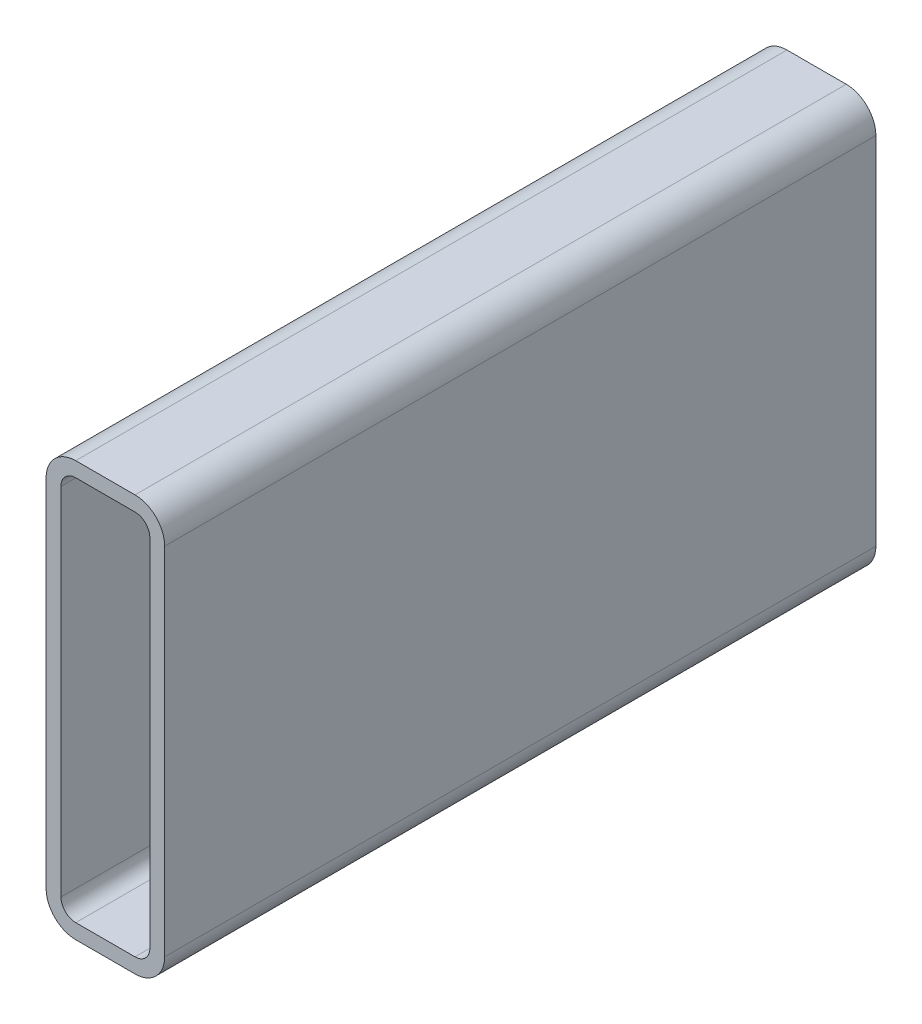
ISO-10303-21;
HEADER;
FILE_DESCRIPTION(('STEP AP214'),'2;1');
FILE_NAME('part.step','',(''),(''),'','','');
FILE_SCHEMA(('AUTOMOTIVE_DESIGN { 1 0 10303 214 1 1 1 1 }'));
ENDSEC;
DATA;
#1=APPLICATION_CONTEXT('core data for automotive mechanical design processes');
#2=APPLICATION_PROTOCOL_DEFINITION('international standard','automotive_design',2000,#1);
#3=PRODUCT_CONTEXT('',#1,'mechanical');
#4=PRODUCT('Part','Part','',(#3));
#5=PRODUCT_RELATED_PRODUCT_CATEGORY('part','',(#4));
#6=PRODUCT_DEFINITION_FORMATION('','',#4);
#7=PRODUCT_DEFINITION_CONTEXT('part definition',#1,'design');
#8=PRODUCT_DEFINITION('design','',#6,#7);
#9=PRODUCT_DEFINITION_SHAPE('','',#8);
#10=(LENGTH_UNIT() NAMED_UNIT(*) SI_UNIT(.MILLI.,.METRE.));
#11=(NAMED_UNIT(*) PLANE_ANGLE_UNIT() SI_UNIT($,.RADIAN.));
#12=(NAMED_UNIT(*) SI_UNIT($,.STERADIAN.) SOLID_ANGLE_UNIT());
#13=UNCERTAINTY_MEASURE_WITH_UNIT(LENGTH_MEASURE(1.E-05),#10,'distance_accuracy_value','');
#14=(GEOMETRIC_REPRESENTATION_CONTEXT(3) GLOBAL_UNCERTAINTY_ASSIGNED_CONTEXT((#13)) GLOBAL_UNIT_ASSIGNED_CONTEXT((#10,
#11,#12)) REPRESENTATION_CONTEXT('',''));
#15=CARTESIAN_POINT('',(0.,0.,0.));
#16=DIRECTION('',(0.,0.,1.));
#17=DIRECTION('',(1.,0.,0.));
#18=AXIS2_PLACEMENT_3D('',#15,#16,#17);
#19=CARTESIAN_POINT('',(12.7,165.1,304.8));
#20=DIRECTION('',(0.,0.,1.));
#21=DIRECTION('',(1.,0.,0.));
#22=AXIS2_PLACEMENT_3D('',#19,#20,#21);
#23=PLANE('',#22);
#24=CARTESIAN_POINT('',(12.7,165.1,304.8));
#25=DIRECTION('',(0.,0.,1.));
#26=DIRECTION('',(1.,0.,0.));
#27=AXIS2_PLACEMENT_3D('',#24,#25,#26);
#28=CIRCLE('',#27,12.7);
#29=CARTESIAN_POINT('',(12.7,177.8,304.8));
#30=VERTEX_POINT('',#29);
#31=CARTESIAN_POINT('',(0.,165.1,304.8));
#32=VERTEX_POINT('',#31);
#33=EDGE_CURVE('E211',#30,#32,#28,.T.);
#34=ORIENTED_EDGE('',*,*,#33,.T.);
#35=DIRECTION('',(0.,-1.,0.));
#36=VECTOR('',#35,1.);
#37=CARTESIAN_POINT('',(0.,12.7,304.8));
#38=LINE('',#37,#36);
#39=CARTESIAN_POINT('',(0.,12.7,304.8));
#40=VERTEX_POINT('',#39);
#41=EDGE_CURVE('E214',#32,#40,#38,.T.);
#42=ORIENTED_EDGE('',*,*,#41,.T.);
#43=CARTESIAN_POINT('',(12.7,12.7,304.8));
#44=DIRECTION('',(0.,0.,1.));
#45=DIRECTION('',(1.,0.,0.));
#46=AXIS2_PLACEMENT_3D('',#43,#44,#45);
#47=CIRCLE('',#46,12.7);
#48=CARTESIAN_POINT('',(12.7,0.,304.8));
#49=VERTEX_POINT('',#48);
#50=EDGE_CURVE('E217',#40,#49,#47,.T.);
#51=ORIENTED_EDGE('',*,*,#50,.T.);
#52=DIRECTION('',(1.,0.,0.));
#53=VECTOR('',#52,1.);
#54=CARTESIAN_POINT('',(38.1,0.,304.8));
#55=LINE('',#54,#53);
#56=CARTESIAN_POINT('',(38.1,0.,304.8));
#57=VERTEX_POINT('',#56);
#58=EDGE_CURVE('E219',#49,#57,#55,.T.);
#59=ORIENTED_EDGE('',*,*,#58,.T.);
#60=CARTESIAN_POINT('',(38.1,12.7,304.8));
#61=DIRECTION('',(0.,0.,1.));
#62=DIRECTION('',(1.,0.,0.));
#63=AXIS2_PLACEMENT_3D('',#60,#61,#62);
#64=CIRCLE('',#63,12.7);
#65=CARTESIAN_POINT('',(50.8,12.7,304.8));
#66=VERTEX_POINT('',#65);
#67=EDGE_CURVE('E221',#57,#66,#64,.T.);
#68=ORIENTED_EDGE('',*,*,#67,.T.);
#69=DIRECTION('',(0.,1.,0.));
#70=VECTOR('',#69,1.);
#71=CARTESIAN_POINT('',(50.8,165.1,304.8));
#72=LINE('',#71,#70);
#73=CARTESIAN_POINT('',(50.8,165.1,304.8));
#74=VERTEX_POINT('',#73);
#75=EDGE_CURVE('E223',#66,#74,#72,.T.);
#76=ORIENTED_EDGE('',*,*,#75,.T.);
#77=CARTESIAN_POINT('',(38.1,165.1,304.8));
#78=DIRECTION('',(0.,0.,1.));
#79=DIRECTION('',(1.,0.,0.));
#80=AXIS2_PLACEMENT_3D('',#77,#78,#79);
#81=CIRCLE('',#80,12.7);
#82=CARTESIAN_POINT('',(38.1,177.8,304.8));
#83=VERTEX_POINT('',#82);
#84=EDGE_CURVE('E225',#74,#83,#81,.T.);
#85=ORIENTED_EDGE('',*,*,#84,.T.);
#86=DIRECTION('',(-1.,0.,0.));
#87=VECTOR('',#86,1.);
#88=CARTESIAN_POINT('',(12.7,177.8,304.8));
#89=LINE('',#88,#87);
#90=EDGE_CURVE('E227',#83,#30,#89,.T.);
#91=ORIENTED_EDGE('',*,*,#90,.T.);
#92=EDGE_LOOP('',(#34,#42,#51,#59,#68,#76,#85,#91));
#93=FACE_BOUND('',#92,.T.);
#94=DIRECTION('',(0.,-1.,0.));
#95=VECTOR('',#94,1.);
#96=CARTESIAN_POINT('',(6.35,12.7,304.8));
#97=LINE('',#96,#95);
#98=CARTESIAN_POINT('',(6.35,165.1,304.8));
#99=VERTEX_POINT('',#98);
#100=CARTESIAN_POINT('',(6.35,12.7,304.8));
#101=VERTEX_POINT('',#100);
#102=EDGE_CURVE('E154',#99,#101,#97,.T.);
#103=ORIENTED_EDGE('',*,*,#102,.F.);
#104=CARTESIAN_POINT('',(12.7,165.1,304.8));
#105=DIRECTION('',(0.,0.,1.));
#106=DIRECTION('',(1.,0.,0.));
#107=AXIS2_PLACEMENT_3D('',#104,#105,#106);
#108=CIRCLE('',#107,6.34999999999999);
#109=CARTESIAN_POINT('',(12.7,171.45,304.8));
#110=VERTEX_POINT('',#109);
#111=EDGE_CURVE('E146',#110,#99,#108,.T.);
#112=ORIENTED_EDGE('',*,*,#111,.F.);
#113=DIRECTION('',(-1.,0.,0.));
#114=VECTOR('',#113,1.);
#115=CARTESIAN_POINT('',(12.7,171.45,304.8));
#116=LINE('',#115,#114);
#117=CARTESIAN_POINT('',(38.1,171.45,304.8));
#118=VERTEX_POINT('',#117);
#119=EDGE_CURVE('E179',#118,#110,#116,.T.);
#120=ORIENTED_EDGE('',*,*,#119,.F.);
#121=CARTESIAN_POINT('',(38.1,165.1,304.8));
#122=DIRECTION('',(0.,0.,1.));
#123=DIRECTION('',(1.,0.,0.));
#124=AXIS2_PLACEMENT_3D('',#121,#122,#123);
#125=CIRCLE('',#124,6.34999999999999);
#126=CARTESIAN_POINT('',(44.45,165.1,304.8));
#127=VERTEX_POINT('',#126);
#128=EDGE_CURVE('E177',#127,#118,#125,.T.);
#129=ORIENTED_EDGE('',*,*,#128,.F.);
#130=DIRECTION('',(0.,1.,0.));
#131=VECTOR('',#130,1.);
#132=CARTESIAN_POINT('',(44.45,165.1,304.8));
#133=LINE('',#132,#131);
#134=CARTESIAN_POINT('',(44.45,12.7,304.8));
#135=VERTEX_POINT('',#134);
#136=EDGE_CURVE('E175',#135,#127,#133,.T.);
#137=ORIENTED_EDGE('',*,*,#136,.F.);
#138=CARTESIAN_POINT('',(38.1,12.7,304.8));
#139=DIRECTION('',(0.,0.,1.));
#140=DIRECTION('',(1.,0.,0.));
#141=AXIS2_PLACEMENT_3D('',#138,#139,#140);
#142=CIRCLE('',#141,6.35);
#143=CARTESIAN_POINT('',(38.1,6.35,304.8));
#144=VERTEX_POINT('',#143);
#145=EDGE_CURVE('E173',#144,#135,#142,.T.);
#146=ORIENTED_EDGE('',*,*,#145,.F.);
#147=DIRECTION('',(1.,0.,0.));
#148=VECTOR('',#147,1.);
#149=CARTESIAN_POINT('',(38.1,6.35,304.8));
#150=LINE('',#149,#148);
#151=CARTESIAN_POINT('',(12.7,6.35,304.8));
#152=VERTEX_POINT('',#151);
#153=EDGE_CURVE('E169',#152,#144,#150,.T.);
#154=ORIENTED_EDGE('',*,*,#153,.F.);
#155=CARTESIAN_POINT('',(12.7,12.7,304.8));
#156=DIRECTION('',(0.,0.,1.));
#157=DIRECTION('',(1.,0.,0.));
#158=AXIS2_PLACEMENT_3D('',#155,#156,#157);
#159=CIRCLE('',#158,6.35);
#160=EDGE_CURVE('E167',#101,#152,#159,.T.);
#161=ORIENTED_EDGE('',*,*,#160,.F.);
#162=EDGE_LOOP('',(#103,#112,#120,#129,#137,#146,#154,#161));
#163=FACE_BOUND('',#162,.T.);
#164=ADVANCED_FACE('F33',(#93,#163),#23,.T.);
#165=CARTESIAN_POINT('',(12.7,165.1,0.));
#166=DIRECTION('',(0.,0.,1.));
#167=DIRECTION('',(1.,0.,0.));
#168=AXIS2_PLACEMENT_3D('',#165,#166,#167);
#169=PLANE('',#168);
#170=CARTESIAN_POINT('',(12.7,165.1,0.));
#171=DIRECTION('',(0.,0.,1.));
#172=DIRECTION('',(1.,0.,0.));
#173=AXIS2_PLACEMENT_3D('',#170,#171,#172);
#174=CIRCLE('',#173,12.7);
#175=CARTESIAN_POINT('',(12.7,177.8,0.));
#176=VERTEX_POINT('',#175);
#177=CARTESIAN_POINT('',(0.,165.1,0.));
#178=VERTEX_POINT('',#177);
#179=EDGE_CURVE('E162',#176,#178,#174,.T.);
#180=ORIENTED_EDGE('',*,*,#179,.F.);
#181=DIRECTION('',(-1.,0.,0.));
#182=VECTOR('',#181,1.);
#183=CARTESIAN_POINT('',(12.7,177.8,0.));
#184=LINE('',#183,#182);
#185=CARTESIAN_POINT('',(38.1,177.8,0.));
#186=VERTEX_POINT('',#185);
#187=EDGE_CURVE('E215',#186,#176,#184,.T.);
#188=ORIENTED_EDGE('',*,*,#187,.F.);
#189=CARTESIAN_POINT('',(38.1,165.1,0.));
#190=DIRECTION('',(0.,0.,1.));
#191=DIRECTION('',(1.,0.,0.));
#192=AXIS2_PLACEMENT_3D('',#189,#190,#191);
#193=CIRCLE('',#192,12.7);
#194=CARTESIAN_POINT('',(50.8,165.1,0.));
#195=VERTEX_POINT('',#194);
#196=EDGE_CURVE('E242',#195,#186,#193,.T.);
#197=ORIENTED_EDGE('',*,*,#196,.F.);
#198=DIRECTION('',(0.,1.,0.));
#199=VECTOR('',#198,1.);
#200=CARTESIAN_POINT('',(50.8,165.1,0.));
#201=LINE('',#200,#199);
#202=CARTESIAN_POINT('',(50.8,12.7,0.));
#203=VERTEX_POINT('',#202);
#204=EDGE_CURVE('E240',#203,#195,#201,.T.);
#205=ORIENTED_EDGE('',*,*,#204,.F.);
#206=CARTESIAN_POINT('',(38.1,12.7,0.));
#207=DIRECTION('',(0.,0.,1.));
#208=DIRECTION('',(1.,0.,0.));
#209=AXIS2_PLACEMENT_3D('',#206,#207,#208);
#210=CIRCLE('',#209,12.7);
#211=CARTESIAN_POINT('',(38.1,0.,0.));
#212=VERTEX_POINT('',#211);
#213=EDGE_CURVE('E238',#212,#203,#210,.T.);
#214=ORIENTED_EDGE('',*,*,#213,.F.);
#215=DIRECTION('',(1.,0.,0.));
#216=VECTOR('',#215,1.);
#217=CARTESIAN_POINT('',(38.1,0.,0.));
#218=LINE('',#217,#216);
#219=CARTESIAN_POINT('',(12.7,0.,0.));
#220=VERTEX_POINT('',#219);
#221=EDGE_CURVE('E236',#220,#212,#218,.T.);
#222=ORIENTED_EDGE('',*,*,#221,.F.);
#223=CARTESIAN_POINT('',(12.7,12.7,0.));
#224=DIRECTION('',(0.,0.,1.));
#225=DIRECTION('',(1.,0.,0.));
#226=AXIS2_PLACEMENT_3D('',#223,#224,#225);
#227=CIRCLE('',#226,12.7);
#228=CARTESIAN_POINT('',(0.,12.7,0.));
#229=VERTEX_POINT('',#228);
#230=EDGE_CURVE('E234',#229,#220,#227,.T.);
#231=ORIENTED_EDGE('',*,*,#230,.F.);
#232=DIRECTION('',(0.,-1.,0.));
#233=VECTOR('',#232,1.);
#234=CARTESIAN_POINT('',(0.,12.7,0.));
#235=LINE('',#234,#233);
#236=EDGE_CURVE('E232',#178,#229,#235,.T.);
#237=ORIENTED_EDGE('',*,*,#236,.F.);
#238=EDGE_LOOP('',(#180,#188,#197,#205,#214,#222,#231,#237));
#239=FACE_BOUND('',#238,.T.);
#240=CARTESIAN_POINT('',(12.7,165.1,0.));
#241=DIRECTION('',(0.,0.,1.));
#242=DIRECTION('',(1.,0.,0.));
#243=AXIS2_PLACEMENT_3D('',#240,#241,#242);
#244=CIRCLE('',#243,6.34999999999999);
#245=CARTESIAN_POINT('',(12.7,171.45,0.));
#246=VERTEX_POINT('',#245);
#247=CARTESIAN_POINT('',(6.35,165.1,0.));
#248=VERTEX_POINT('',#247);
#249=EDGE_CURVE('E56',#246,#248,#244,.T.);
#250=ORIENTED_EDGE('',*,*,#249,.T.);
#251=DIRECTION('',(0.,-1.,0.));
#252=VECTOR('',#251,1.);
#253=CARTESIAN_POINT('',(6.35,12.7,0.));
#254=LINE('',#253,#252);
#255=CARTESIAN_POINT('',(6.35,12.7,0.));
#256=VERTEX_POINT('',#255);
#257=EDGE_CURVE('E161',#248,#256,#254,.T.);
#258=ORIENTED_EDGE('',*,*,#257,.T.);
#259=CARTESIAN_POINT('',(12.7,12.7,0.));
#260=DIRECTION('',(0.,0.,1.));
#261=DIRECTION('',(1.,0.,0.));
#262=AXIS2_PLACEMENT_3D('',#259,#260,#261);
#263=CIRCLE('',#262,6.35);
#264=CARTESIAN_POINT('',(12.7,6.35,0.));
#265=VERTEX_POINT('',#264);
#266=EDGE_CURVE('E183',#256,#265,#263,.T.);
#267=ORIENTED_EDGE('',*,*,#266,.T.);
#268=DIRECTION('',(1.,0.,0.));
#269=VECTOR('',#268,1.);
#270=CARTESIAN_POINT('',(38.1,6.35,0.));
#271=LINE('',#270,#269);
#272=CARTESIAN_POINT('',(38.1,6.35,0.));
#273=VERTEX_POINT('',#272);
#274=EDGE_CURVE('E186',#265,#273,#271,.T.);
#275=ORIENTED_EDGE('',*,*,#274,.T.);
#276=CARTESIAN_POINT('',(38.1,12.7,0.));
#277=DIRECTION('',(0.,0.,1.));
#278=DIRECTION('',(1.,0.,0.));
#279=AXIS2_PLACEMENT_3D('',#276,#277,#278);
#280=CIRCLE('',#279,6.35);
#281=CARTESIAN_POINT('',(44.45,12.7,0.));
#282=VERTEX_POINT('',#281);
#283=EDGE_CURVE('E189',#273,#282,#280,.T.);
#284=ORIENTED_EDGE('',*,*,#283,.T.);
#285=DIRECTION('',(0.,1.,0.));
#286=VECTOR('',#285,1.);
#287=CARTESIAN_POINT('',(44.45,165.1,0.));
#288=LINE('',#287,#286);
#289=CARTESIAN_POINT('',(44.45,165.1,0.));
#290=VERTEX_POINT('',#289);
#291=EDGE_CURVE('E192',#282,#290,#288,.T.);
#292=ORIENTED_EDGE('',*,*,#291,.T.);
#293=CARTESIAN_POINT('',(38.1,165.1,0.));
#294=DIRECTION('',(0.,0.,1.));
#295=DIRECTION('',(1.,0.,0.));
#296=AXIS2_PLACEMENT_3D('',#293,#294,#295);
#297=CIRCLE('',#296,6.34999999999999);
#298=CARTESIAN_POINT('',(38.1,171.45,0.));
#299=VERTEX_POINT('',#298);
#300=EDGE_CURVE('E195',#290,#299,#297,.T.);
#301=ORIENTED_EDGE('',*,*,#300,.T.);
#302=DIRECTION('',(-1.,0.,0.));
#303=VECTOR('',#302,1.);
#304=CARTESIAN_POINT('',(12.7,171.45,0.));
#305=LINE('',#304,#303);
#306=EDGE_CURVE('E155',#299,#246,#305,.T.);
#307=ORIENTED_EDGE('',*,*,#306,.T.);
#308=EDGE_LOOP('',(#250,#258,#267,#275,#284,#292,#301,#307));
#309=FACE_BOUND('',#308,.T.);
#310=ADVANCED_FACE('F272',(#239,#309),#169,.F.);
#311=CARTESIAN_POINT('',(12.7,165.1,304.8));
#312=DIRECTION('',(0.,0.,-1.));
#313=DIRECTION('',(-1.,0.,0.));
#314=AXIS2_PLACEMENT_3D('',#311,#312,#313);
#315=CYLINDRICAL_SURFACE('',#314,12.7);
#316=ORIENTED_EDGE('',*,*,#179,.T.);
#317=DIRECTION('',(0.,0.,-1.));
#318=VECTOR('',#317,1.);
#319=CARTESIAN_POINT('',(0.,165.1,304.8));
#320=LINE('',#319,#318);
#321=EDGE_CURVE('E11',#32,#178,#320,.T.);
#322=ORIENTED_EDGE('',*,*,#321,.F.);
#323=ORIENTED_EDGE('',*,*,#33,.F.);
#324=DIRECTION('',(0.,0.,-1.));
#325=VECTOR('',#324,1.);
#326=CARTESIAN_POINT('',(12.7,177.8,304.8));
#327=LINE('',#326,#325);
#328=EDGE_CURVE('E229',#30,#176,#327,.T.);
#329=ORIENTED_EDGE('',*,*,#328,.T.);
#330=EDGE_LOOP('',(#316,#322,#323,#329));
#331=FACE_BOUND('',#330,.T.);
#332=ADVANCED_FACE('F35',(#331),#315,.T.);
#333=CARTESIAN_POINT('',(0.,12.7,304.8));
#334=DIRECTION('',(1.,0.,0.));
#335=DIRECTION('',(0.,0.,-1.));
#336=AXIS2_PLACEMENT_3D('',#333,#334,#335);
#337=PLANE('',#336);
#338=ORIENTED_EDGE('',*,*,#236,.T.);
#339=DIRECTION('',(0.,0.,-1.));
#340=VECTOR('',#339,1.);
#341=CARTESIAN_POINT('',(0.,12.7,304.8));
#342=LINE('',#341,#340);
#343=EDGE_CURVE('E41',#40,#229,#342,.T.);
#344=ORIENTED_EDGE('',*,*,#343,.F.);
#345=ORIENTED_EDGE('',*,*,#41,.F.);
#346=ORIENTED_EDGE('',*,*,#321,.T.);
#347=EDGE_LOOP('',(#338,#344,#345,#346));
#348=FACE_BOUND('',#347,.T.);
#349=ADVANCED_FACE('F289',(#348),#337,.F.);
#350=CARTESIAN_POINT('',(12.7,12.7,304.8));
#351=DIRECTION('',(0.,0.,-1.));
#352=DIRECTION('',(-1.,0.,0.));
#353=AXIS2_PLACEMENT_3D('',#350,#351,#352);
#354=CYLINDRICAL_SURFACE('',#353,12.7);
#355=ORIENTED_EDGE('',*,*,#230,.T.);
#356=DIRECTION('',(0.,0.,-1.));
#357=VECTOR('',#356,1.);
#358=CARTESIAN_POINT('',(12.7,0.,304.8));
#359=LINE('',#358,#357);
#360=EDGE_CURVE('E259',#49,#220,#359,.T.);
#361=ORIENTED_EDGE('',*,*,#360,.F.);
#362=ORIENTED_EDGE('',*,*,#50,.F.);
#363=ORIENTED_EDGE('',*,*,#343,.T.);
#364=EDGE_LOOP('',(#355,#361,#362,#363));
#365=FACE_BOUND('',#364,.T.);
#366=ADVANCED_FACE('F266',(#365),#354,.T.);
#367=CARTESIAN_POINT('',(38.1,0.,304.8));
#368=DIRECTION('',(0.,1.,0.));
#369=DIRECTION('',(0.,0.,1.));
#370=AXIS2_PLACEMENT_3D('',#367,#368,#369);
#371=PLANE('',#370);
#372=ORIENTED_EDGE('',*,*,#221,.T.);
#373=DIRECTION('',(0.,0.,-1.));
#374=VECTOR('',#373,1.);
#375=CARTESIAN_POINT('',(38.1,0.,304.8));
#376=LINE('',#375,#374);
#377=EDGE_CURVE('E256',#57,#212,#376,.T.);
#378=ORIENTED_EDGE('',*,*,#377,.F.);
#379=ORIENTED_EDGE('',*,*,#58,.F.);
#380=ORIENTED_EDGE('',*,*,#360,.T.);
#381=EDGE_LOOP('',(#372,#378,#379,#380));
#382=FACE_BOUND('',#381,.T.);
#383=ADVANCED_FACE('F278',(#382),#371,.F.);
#384=CARTESIAN_POINT('',(38.1,12.7,304.8));
#385=DIRECTION('',(0.,0.,-1.));
#386=DIRECTION('',(-1.,0.,0.));
#387=AXIS2_PLACEMENT_3D('',#384,#385,#386);
#388=CYLINDRICAL_SURFACE('',#387,12.7);
#389=ORIENTED_EDGE('',*,*,#213,.T.);
#390=DIRECTION('',(0.,0.,-1.));
#391=VECTOR('',#390,1.);
#392=CARTESIAN_POINT('',(50.8,12.7,304.8));
#393=LINE('',#392,#391);
#394=EDGE_CURVE('E253',#66,#203,#393,.T.);
#395=ORIENTED_EDGE('',*,*,#394,.F.);
#396=ORIENTED_EDGE('',*,*,#67,.F.);
#397=ORIENTED_EDGE('',*,*,#377,.T.);
#398=EDGE_LOOP('',(#389,#395,#396,#397));
#399=FACE_BOUND('',#398,.T.);
#400=ADVANCED_FACE('F282',(#399),#388,.T.);
#401=CARTESIAN_POINT('',(50.8,165.1,304.8));
#402=DIRECTION('',(-1.,0.,0.));
#403=DIRECTION('',(0.,0.,1.));
#404=AXIS2_PLACEMENT_3D('',#401,#402,#403);
#405=PLANE('',#404);
#406=ORIENTED_EDGE('',*,*,#204,.T.);
#407=DIRECTION('',(0.,0.,-1.));
#408=VECTOR('',#407,1.);
#409=CARTESIAN_POINT('',(50.8,165.1,304.8));
#410=LINE('',#409,#408);
#411=EDGE_CURVE('E250',#74,#195,#410,.T.);
#412=ORIENTED_EDGE('',*,*,#411,.F.);
#413=ORIENTED_EDGE('',*,*,#75,.F.);
#414=ORIENTED_EDGE('',*,*,#394,.T.);
#415=EDGE_LOOP('',(#406,#412,#413,#414));
#416=FACE_BOUND('',#415,.T.);
#417=ADVANCED_FACE('F302',(#416),#405,.F.);
#418=CARTESIAN_POINT('',(38.1,165.1,304.8));
#419=DIRECTION('',(0.,0.,-1.));
#420=DIRECTION('',(-1.,0.,0.));
#421=AXIS2_PLACEMENT_3D('',#418,#419,#420);
#422=CYLINDRICAL_SURFACE('',#421,12.7);
#423=ORIENTED_EDGE('',*,*,#196,.T.);
#424=DIRECTION('',(0.,0.,-1.));
#425=VECTOR('',#424,1.);
#426=CARTESIAN_POINT('',(38.1,177.8,304.8));
#427=LINE('',#426,#425);
#428=EDGE_CURVE('E247',#83,#186,#427,.T.);
#429=ORIENTED_EDGE('',*,*,#428,.F.);
#430=ORIENTED_EDGE('',*,*,#84,.F.);
#431=ORIENTED_EDGE('',*,*,#411,.T.);
#432=EDGE_LOOP('',(#423,#429,#430,#431));
#433=FACE_BOUND('',#432,.T.);
#434=ADVANCED_FACE('F300',(#433),#422,.T.);
#435=CARTESIAN_POINT('',(12.7,177.8,304.8));
#436=DIRECTION('',(0.,-1.,0.));
#437=DIRECTION('',(0.,0.,-1.));
#438=AXIS2_PLACEMENT_3D('',#435,#436,#437);
#439=PLANE('',#438);
#440=ORIENTED_EDGE('',*,*,#187,.T.);
#441=ORIENTED_EDGE('',*,*,#328,.F.);
#442=ORIENTED_EDGE('',*,*,#90,.F.);
#443=ORIENTED_EDGE('',*,*,#428,.T.);
#444=EDGE_LOOP('',(#440,#441,#442,#443));
#445=FACE_BOUND('',#444,.T.);
#446=ADVANCED_FACE('F295',(#445),#439,.F.);
#447=CARTESIAN_POINT('',(12.7,165.1,304.8));
#448=DIRECTION('',(0.,0.,-1.));
#449=DIRECTION('',(-1.,0.,0.));
#450=AXIS2_PLACEMENT_3D('',#447,#448,#449);
#451=CYLINDRICAL_SURFACE('',#450,6.34999999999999);
#452=ORIENTED_EDGE('',*,*,#249,.F.);
#453=DIRECTION('',(0.,0.,-1.));
#454=VECTOR('',#453,1.);
#455=CARTESIAN_POINT('',(12.7,171.45,304.8));
#456=LINE('',#455,#454);
#457=EDGE_CURVE('E150',#110,#246,#456,.T.);
#458=ORIENTED_EDGE('',*,*,#457,.F.);
#459=ORIENTED_EDGE('',*,*,#111,.T.);
#460=DIRECTION('',(0.,0.,-1.));
#461=VECTOR('',#460,1.);
#462=CARTESIAN_POINT('',(6.35,165.1,304.8));
#463=LINE('',#462,#461);
#464=EDGE_CURVE('E149',#99,#248,#463,.T.);
#465=ORIENTED_EDGE('',*,*,#464,.T.);
#466=EDGE_LOOP('',(#452,#458,#459,#465));
#467=FACE_BOUND('',#466,.T.);
#468=ADVANCED_FACE('F148',(#467),#451,.F.);
#469=CARTESIAN_POINT('',(6.35,12.7,304.8));
#470=DIRECTION('',(1.,0.,0.));
#471=DIRECTION('',(0.,0.,-1.));
#472=AXIS2_PLACEMENT_3D('',#469,#470,#471);
#473=PLANE('',#472);
#474=ORIENTED_EDGE('',*,*,#257,.F.);
#475=ORIENTED_EDGE('',*,*,#464,.F.);
#476=ORIENTED_EDGE('',*,*,#102,.T.);
#477=DIRECTION('',(0.,0.,-1.));
#478=VECTOR('',#477,1.);
#479=CARTESIAN_POINT('',(6.35,12.7,304.8));
#480=LINE('',#479,#478);
#481=EDGE_CURVE('E163',#101,#256,#480,.T.);
#482=ORIENTED_EDGE('',*,*,#481,.T.);
#483=EDGE_LOOP('',(#474,#475,#476,#482));
#484=FACE_BOUND('',#483,.T.);
#485=ADVANCED_FACE('F158',(#484),#473,.T.);
#486=CARTESIAN_POINT('',(12.7,12.7,304.8));
#487=DIRECTION('',(0.,0.,-1.));
#488=DIRECTION('',(-1.,0.,0.));
#489=AXIS2_PLACEMENT_3D('',#486,#487,#488);
#490=CYLINDRICAL_SURFACE('',#489,6.35);
#491=ORIENTED_EDGE('',*,*,#266,.F.);
#492=ORIENTED_EDGE('',*,*,#481,.F.);
#493=ORIENTED_EDGE('',*,*,#160,.T.);
#494=DIRECTION('',(0.,0.,-1.));
#495=VECTOR('',#494,1.);
#496=CARTESIAN_POINT('',(12.7,6.35,304.8));
#497=LINE('',#496,#495);
#498=EDGE_CURVE('E208',#152,#265,#497,.T.);
#499=ORIENTED_EDGE('',*,*,#498,.T.);
#500=EDGE_LOOP('',(#491,#492,#493,#499));
#501=FACE_BOUND('',#500,.T.);
#502=ADVANCED_FACE('F327',(#501),#490,.F.);
#503=CARTESIAN_POINT('',(38.1,6.35,304.8));
#504=DIRECTION('',(0.,1.,0.));
#505=DIRECTION('',(0.,0.,1.));
#506=AXIS2_PLACEMENT_3D('',#503,#504,#505);
#507=PLANE('',#506);
#508=ORIENTED_EDGE('',*,*,#274,.F.);
#509=ORIENTED_EDGE('',*,*,#498,.F.);
#510=ORIENTED_EDGE('',*,*,#153,.T.);
#511=DIRECTION('',(0.,0.,-1.));
#512=VECTOR('',#511,1.);
#513=CARTESIAN_POINT('',(38.1,6.35,304.8));
#514=LINE('',#513,#512);
#515=EDGE_CURVE('E206',#144,#273,#514,.T.);
#516=ORIENTED_EDGE('',*,*,#515,.T.);
#517=EDGE_LOOP('',(#508,#509,#510,#516));
#518=FACE_BOUND('',#517,.T.);
#519=ADVANCED_FACE('F331',(#518),#507,.T.);
#520=CARTESIAN_POINT('',(38.1,12.7,304.8));
#521=DIRECTION('',(0.,0.,-1.));
#522=DIRECTION('',(-1.,0.,0.));
#523=AXIS2_PLACEMENT_3D('',#520,#521,#522);
#524=CYLINDRICAL_SURFACE('',#523,6.35);
#525=ORIENTED_EDGE('',*,*,#283,.F.);
#526=ORIENTED_EDGE('',*,*,#515,.F.);
#527=ORIENTED_EDGE('',*,*,#145,.T.);
#528=DIRECTION('',(0.,0.,-1.));
#529=VECTOR('',#528,1.);
#530=CARTESIAN_POINT('',(44.45,12.7,304.8));
#531=LINE('',#530,#529);
#532=EDGE_CURVE('E204',#135,#282,#531,.T.);
#533=ORIENTED_EDGE('',*,*,#532,.T.);
#534=EDGE_LOOP('',(#525,#526,#527,#533));
#535=FACE_BOUND('',#534,.T.);
#536=ADVANCED_FACE('F337',(#535),#524,.F.);
#537=CARTESIAN_POINT('',(44.45,165.1,304.8));
#538=DIRECTION('',(-1.,0.,0.));
#539=DIRECTION('',(0.,0.,1.));
#540=AXIS2_PLACEMENT_3D('',#537,#538,#539);
#541=PLANE('',#540);
#542=ORIENTED_EDGE('',*,*,#291,.F.);
#543=ORIENTED_EDGE('',*,*,#532,.F.);
#544=ORIENTED_EDGE('',*,*,#136,.T.);
#545=DIRECTION('',(0.,0.,-1.));
#546=VECTOR('',#545,1.);
#547=CARTESIAN_POINT('',(44.45,165.1,304.8));
#548=LINE('',#547,#546);
#549=EDGE_CURVE('E202',#127,#290,#548,.T.);
#550=ORIENTED_EDGE('',*,*,#549,.T.);
#551=EDGE_LOOP('',(#542,#543,#544,#550));
#552=FACE_BOUND('',#551,.T.);
#553=ADVANCED_FACE('F341',(#552),#541,.T.);
#554=CARTESIAN_POINT('',(38.1,165.1,304.8));
#555=DIRECTION('',(0.,0.,-1.));
#556=DIRECTION('',(-1.,0.,0.));
#557=AXIS2_PLACEMENT_3D('',#554,#555,#556);
#558=CYLINDRICAL_SURFACE('',#557,6.34999999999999);
#559=ORIENTED_EDGE('',*,*,#300,.F.);
#560=ORIENTED_EDGE('',*,*,#549,.F.);
#561=ORIENTED_EDGE('',*,*,#128,.T.);
#562=DIRECTION('',(0.,0.,-1.));
#563=VECTOR('',#562,1.);
#564=CARTESIAN_POINT('',(38.1,171.45,304.8));
#565=LINE('',#564,#563);
#566=EDGE_CURVE('E48',#118,#299,#565,.T.);
#567=ORIENTED_EDGE('',*,*,#566,.T.);
#568=EDGE_LOOP('',(#559,#560,#561,#567));
#569=FACE_BOUND('',#568,.T.);
#570=ADVANCED_FACE('F345',(#569),#558,.F.);
#571=CARTESIAN_POINT('',(12.7,171.45,304.8));
#572=DIRECTION('',(0.,-1.,0.));
#573=DIRECTION('',(0.,0.,-1.));
#574=AXIS2_PLACEMENT_3D('',#571,#572,#573);
#575=PLANE('',#574);
#576=ORIENTED_EDGE('',*,*,#306,.F.);
#577=ORIENTED_EDGE('',*,*,#566,.F.);
#578=ORIENTED_EDGE('',*,*,#119,.T.);
#579=ORIENTED_EDGE('',*,*,#457,.T.);
#580=EDGE_LOOP('',(#576,#577,#578,#579));
#581=FACE_BOUND('',#580,.T.);
#582=ADVANCED_FACE('F349',(#581),#575,.T.);
#583=CLOSED_SHELL('',(#164,#310,#332,#349,#366,#383,#400,#417,#434,#446,#468,#485,#502,#519,
#536,#553,#570,#582));
#584=MANIFOLD_SOLID_BREP('B2',#583);
#585=ADVANCED_BREP_SHAPE_REPRESENTATION('',(#18,#584),#14);
#586=SHAPE_DEFINITION_REPRESENTATION(#9,#585);
ENDSEC;
END-ISO-10303-21;
